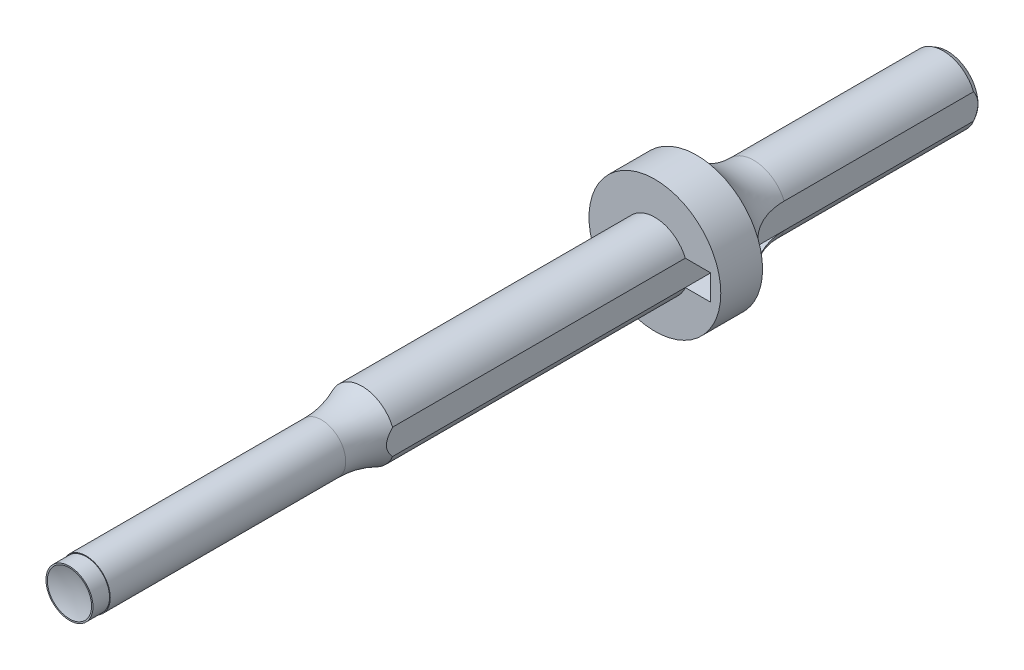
from build123d import *

# Parameters (mm, degrees)
SKETCH1_R           = 4.765
BOSS_EXTRUDE1_DEPTH = 127
SKETCH2_OUTSIDE_W   = 37.072
SKETCH2_OUTSIDE_H   = 37.072
SKETCH2_OUTSIDE_R   = 3.5
CUT_EXTRUDE1_DEPTH  = 42.333
SKETCH3_OUTSIDE_W   = 37.072
SKETCH3_OUTSIDE_H   = 37.072
SKETCH3_OUTSIDE_R   = 3.4
CUT_EXTRUDE2_DEPTH  = 2.4
CHAMFER1_SIZE       = 0.64
CHAMFER1_SIZE2      = 0.369504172
SKETCH7_W           = 3.67958771
SKETCH7_H           = 3.67958771
CUT_EXTRUDE3_DEPTH  = 128.713123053


with BuildPart() as part:
    # Sketch1 → Boss-Extrude1 (new body)
    with BuildSketch(Plane.XY):
        Circle(SKETCH1_R)
    extrude(amount=-BOSS_EXTRUDE1_DEPTH)

    # Sketch2 outside → Cut-Extrude1 (cut)
    with BuildSketch(Plane.XY):
        Rectangle(SKETCH2_OUTSIDE_W, SKETCH2_OUTSIDE_H)
        Circle(SKETCH2_OUTSIDE_R, mode=Mode.SUBTRACT)
    extrude(amount=-CUT_EXTRUDE1_DEPTH, mode=Mode.SUBTRACT)

    # Sketch3 outside → Cut-Extrude2 (cut)
    with BuildSketch(Plane.XY):
        Rectangle(SKETCH3_OUTSIDE_W, SKETCH3_OUTSIDE_H)
        Circle(SKETCH3_OUTSIDE_R, mode=Mode.SUBTRACT)
    extrude(amount=-CUT_EXTRUDE2_DEPTH, mode=Mode.SUBTRACT)

    # Sketch4 → Cut-Revolve1 (revolve, cut)
    with BuildSketch(Plane(origin=(0, 0, 0), x_dir=(0, 0, -1), z_dir=(1, 0, 0))):
        with BuildLine():
            Line((0, 0), (0, 3.2))
            ThreePointArc((0, 3.2), (0.413966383, 1.623742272), (0.553313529, 0))
            Line((0.553313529, 0), (0, 0))
        make_face()
    revolve(axis=Axis((0, 0, 0), (0, 0, -1)), mode=Mode.SUBTRACT)

    # Chamfer1
    chamfer1_edges = [part.edges().sort_by_distance(p)[0] for p in [
        (-4.765, 0, -127),
    ]]
    chamfer1_side = [part.faces().sort_by_distance(p)[0] for p in [
        (-4.765, 0, -84.6665),
    ]]
    chamfer(chamfer1_edges, length=CHAMFER1_SIZE, length2=CHAMFER1_SIZE2, reference=chamfer1_side[0])

    # Sketch5 → Revolve1 (revolve)
    with BuildSketch(Plane(origin=(0, 0, 0), x_dir=(0, 0, -1), z_dir=(1, 0, 0)), mode=Mode.PRIVATE) as revolve1_sk:
        with BuildLine():
            Line((42.333, 0), (36.453703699, 0))
            Line((36.453703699, 0), (36.453703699, 3.5))
            ThreePointArc((36.453703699, 3.5), (39.46062696, 3.819827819), (42.333, 4.765))
            Line((42.333, 4.765), (42.333, 0))
        make_face()
    revolve(revolve1_sk.sketch.rotate(Axis((0, 0, -42.333), (0, 0, 1)), 270), axis=Axis((0, 0, -42.333), (0, 0, 1)))

    # Sketch6 → Revolve2 (revolve)
    with BuildSketch(Plane(origin=(0, 0, 0), x_dir=(0, 0, -1), z_dir=(1, 0, 0)), mode=Mode.PRIVATE) as revolve2_sk:
        with BuildLine():
            Line((84.667, 0), (98.962, 0))
            Line((98.962, 0), (98.962, 4.765))
            ThreePointArc((98.962, 4.765), (94.197, 6.041777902), (90.708777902, 9.53))
            Line((90.708777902, 9.53), (84.667, 9.53))
            Line((84.667, 9.53), (84.667, 0))
        make_face()
    revolve(revolve2_sk.sketch.rotate(Axis((0, 0, -84.667), (0, 0, -1)), 90), axis=Axis((0, 0, -84.667), (0, 0, -1)))

    # Sketch7 → Cut-Extrude3 (cut, through all)
    with BuildSketch(Plane(origin=(0, 0, -127), x_dir=(-1, 0, 0), z_dir=(0, 0, -1))):
        with Locations((-6.235289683, 0)):
            Rectangle(SKETCH7_W, SKETCH7_H)
    extrude(amount=-CUT_EXTRUDE3_DEPTH, mode=Mode.SUBTRACT)


solid = part.part
